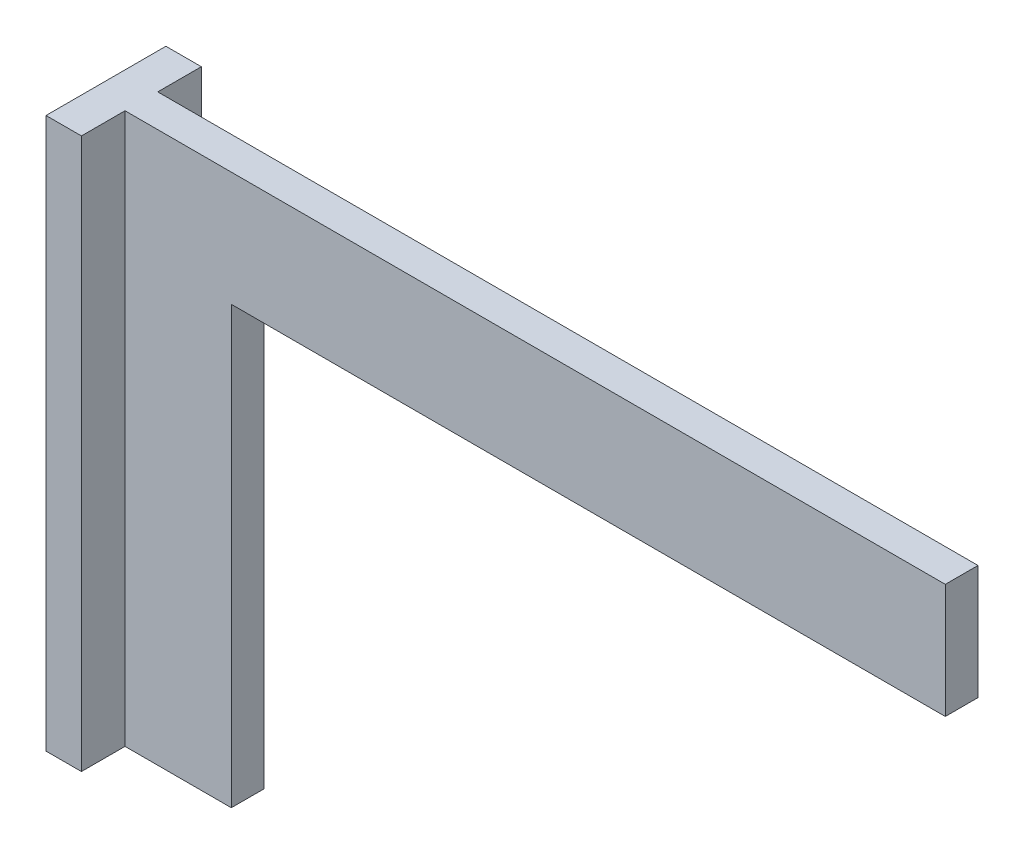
ISO-10303-21;
HEADER;
FILE_DESCRIPTION(('STEP AP214'),'2;1');
FILE_NAME('part.step','',(''),(''),'','','');
FILE_SCHEMA(('AUTOMOTIVE_DESIGN { 1 0 10303 214 1 1 1 1 }'));
ENDSEC;
DATA;
#1=APPLICATION_CONTEXT('core data for automotive mechanical design processes');
#2=APPLICATION_PROTOCOL_DEFINITION('international standard','automotive_design',2000,#1);
#3=PRODUCT_CONTEXT('',#1,'mechanical');
#4=PRODUCT('Part','Part','',(#3));
#5=PRODUCT_RELATED_PRODUCT_CATEGORY('part','',(#4));
#6=PRODUCT_DEFINITION_FORMATION('','',#4);
#7=PRODUCT_DEFINITION_CONTEXT('part definition',#1,'design');
#8=PRODUCT_DEFINITION('design','',#6,#7);
#9=PRODUCT_DEFINITION_SHAPE('','',#8);
#10=(LENGTH_UNIT() NAMED_UNIT(*) SI_UNIT(.MILLI.,.METRE.));
#11=(NAMED_UNIT(*) PLANE_ANGLE_UNIT() SI_UNIT($,.RADIAN.));
#12=(NAMED_UNIT(*) SI_UNIT($,.STERADIAN.) SOLID_ANGLE_UNIT());
#13=UNCERTAINTY_MEASURE_WITH_UNIT(LENGTH_MEASURE(1.E-05),#10,'distance_accuracy_value','');
#14=(GEOMETRIC_REPRESENTATION_CONTEXT(3) GLOBAL_UNCERTAINTY_ASSIGNED_CONTEXT((#13)) GLOBAL_UNIT_ASSIGNED_CONTEXT((#10,
#11,#12)) REPRESENTATION_CONTEXT('',''));
#15=CARTESIAN_POINT('',(0.,0.,0.));
#16=DIRECTION('',(0.,0.,1.));
#17=DIRECTION('',(1.,0.,0.));
#18=AXIS2_PLACEMENT_3D('',#15,#16,#17);
#19=CARTESIAN_POINT('',(26.,0.,6.));
#20=DIRECTION('',(0.,1.,0.));
#21=DIRECTION('',(-1.,0.,0.));
#22=AXIS2_PLACEMENT_3D('',#19,#20,#21);
#23=PLANE('',#22);
#24=DIRECTION('',(1.,0.,0.));
#25=VECTOR('',#24,1.);
#26=CARTESIAN_POINT('',(26.,0.,6.));
#27=LINE('',#26,#25);
#28=CARTESIAN_POINT('',(6.50000000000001,0.,6.));
#29=VERTEX_POINT('',#28);
#30=CARTESIAN_POINT('',(26.,0.,6.));
#31=VERTEX_POINT('',#30);
#32=EDGE_CURVE('E171',#29,#31,#27,.T.);
#33=ORIENTED_EDGE('',*,*,#32,.F.);
#34=DIRECTION('',(0.,0.,1.));
#35=VECTOR('',#34,1.);
#36=CARTESIAN_POINT('',(6.50000000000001,0.,-8.));
#37=LINE('',#36,#35);
#38=CARTESIAN_POINT('',(6.50000000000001,0.,14.));
#39=VERTEX_POINT('',#38);
#40=EDGE_CURVE('E130',#29,#39,#37,.T.);
#41=ORIENTED_EDGE('',*,*,#40,.T.);
#42=DIRECTION('',(1.,0.,0.));
#43=VECTOR('',#42,1.);
#44=CARTESIAN_POINT('',(0.,0.,14.));
#45=LINE('',#44,#43);
#46=CARTESIAN_POINT('',(0.,0.,14.));
#47=VERTEX_POINT('',#46);
#48=EDGE_CURVE('E128',#47,#39,#45,.T.);
#49=ORIENTED_EDGE('',*,*,#48,.F.);
#50=DIRECTION('',(0.,0.,-1.));
#51=VECTOR('',#50,1.);
#52=CARTESIAN_POINT('',(0.,0.,6.));
#53=LINE('',#52,#51);
#54=CARTESIAN_POINT('',(0.,0.,-8.));
#55=VERTEX_POINT('',#54);
#56=EDGE_CURVE('E116',#47,#55,#53,.T.);
#57=ORIENTED_EDGE('',*,*,#56,.T.);
#58=DIRECTION('',(1.,0.,0.));
#59=VECTOR('',#58,1.);
#60=CARTESIAN_POINT('',(0.,0.,-8.));
#61=LINE('',#60,#59);
#62=CARTESIAN_POINT('',(6.50000000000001,0.,-8.));
#63=VERTEX_POINT('',#62);
#64=EDGE_CURVE('E150',#55,#63,#61,.T.);
#65=ORIENTED_EDGE('',*,*,#64,.T.);
#66=CARTESIAN_POINT('',(6.50000000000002,0.,0.));
#67=VERTEX_POINT('',#66);
#68=EDGE_CURVE('E62',#63,#67,#37,.T.);
#69=ORIENTED_EDGE('',*,*,#68,.T.);
#70=DIRECTION('',(1.,0.,0.));
#71=VECTOR('',#70,1.);
#72=CARTESIAN_POINT('',(26.,0.,0.));
#73=LINE('',#72,#71);
#74=CARTESIAN_POINT('',(26.,0.,0.));
#75=VERTEX_POINT('',#74);
#76=EDGE_CURVE('E170',#67,#75,#73,.T.);
#77=ORIENTED_EDGE('',*,*,#76,.T.);
#78=DIRECTION('',(0.,0.,-1.));
#79=VECTOR('',#78,1.);
#80=CARTESIAN_POINT('',(26.,0.,6.));
#81=LINE('',#80,#79);
#82=EDGE_CURVE('E47',#31,#75,#81,.T.);
#83=ORIENTED_EDGE('',*,*,#82,.F.);
#84=EDGE_LOOP('',(#33,#41,#49,#57,#65,#69,#77,#83));
#85=FACE_BOUND('',#84,.T.);
#86=ADVANCED_FACE('F39',(#85),#23,.F.);
#87=CARTESIAN_POINT('',(26.,80.,6.));
#88=DIRECTION('',(-1.,0.,0.));
#89=DIRECTION('',(0.,-1.,0.));
#90=AXIS2_PLACEMENT_3D('',#87,#88,#89);
#91=PLANE('',#90);
#92=DIRECTION('',(0.,1.,0.));
#93=VECTOR('',#92,1.);
#94=CARTESIAN_POINT('',(26.,80.,0.));
#95=LINE('',#94,#93);
#96=CARTESIAN_POINT('',(26.,80.,0.));
#97=VERTEX_POINT('',#96);
#98=EDGE_CURVE('E188',#75,#97,#95,.T.);
#99=ORIENTED_EDGE('',*,*,#98,.T.);
#100=DIRECTION('',(0.,0.,-1.));
#101=VECTOR('',#100,1.);
#102=CARTESIAN_POINT('',(26.,80.,6.));
#103=LINE('',#102,#101);
#104=CARTESIAN_POINT('',(26.,80.,6.));
#105=VERTEX_POINT('',#104);
#106=EDGE_CURVE('E210',#105,#97,#103,.T.);
#107=ORIENTED_EDGE('',*,*,#106,.F.);
#108=DIRECTION('',(0.,1.,0.));
#109=VECTOR('',#108,1.);
#110=CARTESIAN_POINT('',(26.,80.,6.));
#111=LINE('',#110,#109);
#112=EDGE_CURVE('E174',#31,#105,#111,.T.);
#113=ORIENTED_EDGE('',*,*,#112,.F.);
#114=ORIENTED_EDGE('',*,*,#82,.T.);
#115=EDGE_LOOP('',(#99,#107,#113,#114));
#116=FACE_BOUND('',#115,.T.);
#117=ADVANCED_FACE('F218',(#116),#91,.F.);
#118=CARTESIAN_POINT('',(157.,80.,6.));
#119=DIRECTION('',(0.,1.,0.));
#120=DIRECTION('',(-1.,0.,0.));
#121=AXIS2_PLACEMENT_3D('',#118,#119,#120);
#122=PLANE('',#121);
#123=DIRECTION('',(1.,0.,0.));
#124=VECTOR('',#123,1.);
#125=CARTESIAN_POINT('',(157.,80.,0.));
#126=LINE('',#125,#124);
#127=CARTESIAN_POINT('',(157.,80.,0.));
#128=VERTEX_POINT('',#127);
#129=EDGE_CURVE('E191',#97,#128,#126,.T.);
#130=ORIENTED_EDGE('',*,*,#129,.T.);
#131=DIRECTION('',(0.,0.,-1.));
#132=VECTOR('',#131,1.);
#133=CARTESIAN_POINT('',(157.,80.,6.));
#134=LINE('',#133,#132);
#135=CARTESIAN_POINT('',(157.,80.,6.));
#136=VERTEX_POINT('',#135);
#137=EDGE_CURVE('E206',#136,#128,#134,.T.);
#138=ORIENTED_EDGE('',*,*,#137,.F.);
#139=DIRECTION('',(1.,0.,0.));
#140=VECTOR('',#139,1.);
#141=CARTESIAN_POINT('',(157.,80.,6.));
#142=LINE('',#141,#140);
#143=EDGE_CURVE('E178',#105,#136,#142,.T.);
#144=ORIENTED_EDGE('',*,*,#143,.F.);
#145=ORIENTED_EDGE('',*,*,#106,.T.);
#146=EDGE_LOOP('',(#130,#138,#144,#145));
#147=FACE_BOUND('',#146,.T.);
#148=ADVANCED_FACE('F230',(#147),#122,.F.);
#149=CARTESIAN_POINT('',(157.,101.,6.));
#150=DIRECTION('',(-1.,0.,0.));
#151=DIRECTION('',(0.,0.,1.));
#152=AXIS2_PLACEMENT_3D('',#149,#150,#151);
#153=PLANE('',#152);
#154=DIRECTION('',(0.,1.,0.));
#155=VECTOR('',#154,1.);
#156=CARTESIAN_POINT('',(157.,101.,0.));
#157=LINE('',#156,#155);
#158=CARTESIAN_POINT('',(157.,101.,0.));
#159=VERTEX_POINT('',#158);
#160=EDGE_CURVE('E194',#128,#159,#157,.T.);
#161=ORIENTED_EDGE('',*,*,#160,.T.);
#162=DIRECTION('',(0.,0.,-1.));
#163=VECTOR('',#162,1.);
#164=CARTESIAN_POINT('',(157.,101.,6.));
#165=LINE('',#164,#163);
#166=CARTESIAN_POINT('',(157.,101.,6.));
#167=VERTEX_POINT('',#166);
#168=EDGE_CURVE('E202',#167,#159,#165,.T.);
#169=ORIENTED_EDGE('',*,*,#168,.F.);
#170=DIRECTION('',(0.,1.,0.));
#171=VECTOR('',#170,1.);
#172=CARTESIAN_POINT('',(157.,101.,6.));
#173=LINE('',#172,#171);
#174=EDGE_CURVE('E181',#136,#167,#173,.T.);
#175=ORIENTED_EDGE('',*,*,#174,.F.);
#176=ORIENTED_EDGE('',*,*,#137,.T.);
#177=EDGE_LOOP('',(#161,#169,#175,#176));
#178=FACE_BOUND('',#177,.T.);
#179=ADVANCED_FACE('F234',(#178),#153,.F.);
#180=CARTESIAN_POINT('',(0.,101.,6.));
#181=DIRECTION('',(0.,-1.,0.));
#182=DIRECTION('',(0.,0.,-1.));
#183=AXIS2_PLACEMENT_3D('',#180,#181,#182);
#184=PLANE('',#183);
#185=DIRECTION('',(-1.,0.,0.));
#186=VECTOR('',#185,1.);
#187=CARTESIAN_POINT('',(0.,101.,0.));
#188=LINE('',#187,#186);
#189=CARTESIAN_POINT('',(6.5,101.,0.));
#190=VERTEX_POINT('',#189);
#191=EDGE_CURVE('E175',#159,#190,#188,.T.);
#192=ORIENTED_EDGE('',*,*,#191,.T.);
#193=DIRECTION('',(0.,0.,1.));
#194=VECTOR('',#193,1.);
#195=CARTESIAN_POINT('',(6.5,101.,-8.));
#196=LINE('',#195,#194);
#197=CARTESIAN_POINT('',(6.5,101.,-8.));
#198=VERTEX_POINT('',#197);
#199=EDGE_CURVE('E161',#198,#190,#196,.T.);
#200=ORIENTED_EDGE('',*,*,#199,.F.);
#201=DIRECTION('',(-1.,0.,0.));
#202=VECTOR('',#201,1.);
#203=CARTESIAN_POINT('',(0.,101.,-8.));
#204=LINE('',#203,#202);
#205=CARTESIAN_POINT('',(0.,101.,-8.));
#206=VERTEX_POINT('',#205);
#207=EDGE_CURVE('E157',#198,#206,#204,.T.);
#208=ORIENTED_EDGE('',*,*,#207,.T.);
#209=DIRECTION('',(0.,0.,-1.));
#210=VECTOR('',#209,1.);
#211=CARTESIAN_POINT('',(0.,101.,6.));
#212=LINE('',#211,#210);
#213=CARTESIAN_POINT('',(0.,101.,14.));
#214=VERTEX_POINT('',#213);
#215=EDGE_CURVE('E125',#214,#206,#212,.T.);
#216=ORIENTED_EDGE('',*,*,#215,.F.);
#217=DIRECTION('',(-1.,0.,0.));
#218=VECTOR('',#217,1.);
#219=CARTESIAN_POINT('',(0.,101.,14.));
#220=LINE('',#219,#218);
#221=CARTESIAN_POINT('',(6.5,101.,14.));
#222=VERTEX_POINT('',#221);
#223=EDGE_CURVE('E140',#222,#214,#220,.T.);
#224=ORIENTED_EDGE('',*,*,#223,.F.);
#225=CARTESIAN_POINT('',(6.50000000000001,101.,6.));
#226=VERTEX_POINT('',#225);
#227=EDGE_CURVE('E165',#226,#222,#196,.T.);
#228=ORIENTED_EDGE('',*,*,#227,.F.);
#229=DIRECTION('',(-1.,0.,0.));
#230=VECTOR('',#229,1.);
#231=CARTESIAN_POINT('',(0.,101.,6.));
#232=LINE('',#231,#230);
#233=EDGE_CURVE('E54',#167,#226,#232,.T.);
#234=ORIENTED_EDGE('',*,*,#233,.F.);
#235=ORIENTED_EDGE('',*,*,#168,.T.);
#236=EDGE_LOOP('',(#192,#200,#208,#216,#224,#228,#234,#235));
#237=FACE_BOUND('',#236,.T.);
#238=ADVANCED_FACE('F243',(#237),#184,.F.);
#239=CARTESIAN_POINT('',(0.,0.,6.));
#240=DIRECTION('',(1.,0.,0.));
#241=DIRECTION('',(0.,0.,-1.));
#242=AXIS2_PLACEMENT_3D('',#239,#240,#241);
#243=PLANE('',#242);
#244=ORIENTED_EDGE('',*,*,#215,.T.);
#245=DIRECTION('',(0.,-1.,0.));
#246=VECTOR('',#245,1.);
#247=CARTESIAN_POINT('',(0.,101.,-8.));
#248=LINE('',#247,#246);
#249=EDGE_CURVE('E122',#206,#55,#248,.T.);
#250=ORIENTED_EDGE('',*,*,#249,.T.);
#251=ORIENTED_EDGE('',*,*,#56,.F.);
#252=DIRECTION('',(0.,-1.,0.));
#253=VECTOR('',#252,1.);
#254=CARTESIAN_POINT('',(0.,101.,14.));
#255=LINE('',#254,#253);
#256=EDGE_CURVE('E120',#214,#47,#255,.T.);
#257=ORIENTED_EDGE('',*,*,#256,.F.);
#258=EDGE_LOOP('',(#244,#250,#251,#257));
#259=FACE_BOUND('',#258,.T.);
#260=ADVANCED_FACE('F118',(#259),#243,.F.);
#261=CARTESIAN_POINT('',(0.,0.,6.));
#262=DIRECTION('',(0.,0.,-1.));
#263=DIRECTION('',(-1.,0.,0.));
#264=AXIS2_PLACEMENT_3D('',#261,#262,#263);
#265=PLANE('',#264);
#266=ORIENTED_EDGE('',*,*,#233,.T.);
#267=DIRECTION('',(0.,-1.,0.));
#268=VECTOR('',#267,1.);
#269=CARTESIAN_POINT('',(6.50000000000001,0.,6.));
#270=LINE('',#269,#268);
#271=EDGE_CURVE('E164',#226,#29,#270,.T.);
#272=ORIENTED_EDGE('',*,*,#271,.T.);
#273=ORIENTED_EDGE('',*,*,#32,.T.);
#274=ORIENTED_EDGE('',*,*,#112,.T.);
#275=ORIENTED_EDGE('',*,*,#143,.T.);
#276=ORIENTED_EDGE('',*,*,#174,.T.);
#277=EDGE_LOOP('',(#266,#272,#273,#274,#275,#276));
#278=FACE_BOUND('',#277,.T.);
#279=ADVANCED_FACE('F236',(#278),#265,.F.);
#280=CARTESIAN_POINT('',(0.,0.,0.));
#281=DIRECTION('',(0.,0.,-1.));
#282=DIRECTION('',(-1.,0.,0.));
#283=AXIS2_PLACEMENT_3D('',#280,#281,#282);
#284=PLANE('',#283);
#285=DIRECTION('',(0.,-1.,0.));
#286=VECTOR('',#285,1.);
#287=CARTESIAN_POINT('',(6.50000000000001,0.,0.));
#288=LINE('',#287,#286);
#289=EDGE_CURVE('E11',#190,#67,#288,.T.);
#290=ORIENTED_EDGE('',*,*,#289,.F.);
#291=ORIENTED_EDGE('',*,*,#191,.F.);
#292=ORIENTED_EDGE('',*,*,#160,.F.);
#293=ORIENTED_EDGE('',*,*,#129,.F.);
#294=ORIENTED_EDGE('',*,*,#98,.F.);
#295=ORIENTED_EDGE('',*,*,#76,.F.);
#296=EDGE_LOOP('',(#290,#291,#292,#293,#294,#295));
#297=FACE_BOUND('',#296,.T.);
#298=ADVANCED_FACE('F225',(#297),#284,.T.);
#299=CARTESIAN_POINT('',(0.,0.,-8.));
#300=DIRECTION('',(0.,0.,1.));
#301=DIRECTION('',(1.,0.,0.));
#302=AXIS2_PLACEMENT_3D('',#299,#300,#301);
#303=PLANE('',#302);
#304=ORIENTED_EDGE('',*,*,#249,.F.);
#305=ORIENTED_EDGE('',*,*,#207,.F.);
#306=DIRECTION('',(0.,1.,0.));
#307=VECTOR('',#306,1.);
#308=CARTESIAN_POINT('',(6.5,101.,-8.));
#309=LINE('',#308,#307);
#310=EDGE_CURVE('E153',#63,#198,#309,.T.);
#311=ORIENTED_EDGE('',*,*,#310,.F.);
#312=ORIENTED_EDGE('',*,*,#64,.F.);
#313=EDGE_LOOP('',(#304,#305,#311,#312));
#314=FACE_BOUND('',#313,.T.);
#315=ADVANCED_FACE('F246',(#314),#303,.F.);
#316=CARTESIAN_POINT('',(6.5,101.,-8.));
#317=DIRECTION('',(1.,0.,0.));
#318=DIRECTION('',(0.,1.,0.));
#319=AXIS2_PLACEMENT_3D('',#316,#317,#318);
#320=PLANE('',#319);
#321=ORIENTED_EDGE('',*,*,#199,.T.);
#322=ORIENTED_EDGE('',*,*,#289,.T.);
#323=ORIENTED_EDGE('',*,*,#68,.F.);
#324=ORIENTED_EDGE('',*,*,#310,.T.);
#325=EDGE_LOOP('',(#321,#322,#323,#324));
#326=FACE_BOUND('',#325,.T.);
#327=ADVANCED_FACE('F249',(#326),#320,.T.);
#328=ORIENTED_EDGE('',*,*,#271,.F.);
#329=ORIENTED_EDGE('',*,*,#227,.T.);
#330=DIRECTION('',(0.,1.,0.));
#331=VECTOR('',#330,1.);
#332=CARTESIAN_POINT('',(6.5,101.,14.));
#333=LINE('',#332,#331);
#334=EDGE_CURVE('E135',#39,#222,#333,.T.);
#335=ORIENTED_EDGE('',*,*,#334,.F.);
#336=ORIENTED_EDGE('',*,*,#40,.F.);
#337=EDGE_LOOP('',(#328,#329,#335,#336));
#338=FACE_BOUND('',#337,.T.);
#339=ADVANCED_FACE('F239',(#338),#320,.T.);
#340=CARTESIAN_POINT('',(0.,0.,14.));
#341=DIRECTION('',(0.,0.,1.));
#342=DIRECTION('',(1.,0.,0.));
#343=AXIS2_PLACEMENT_3D('',#340,#341,#342);
#344=PLANE('',#343);
#345=ORIENTED_EDGE('',*,*,#256,.T.);
#346=ORIENTED_EDGE('',*,*,#48,.T.);
#347=ORIENTED_EDGE('',*,*,#334,.T.);
#348=ORIENTED_EDGE('',*,*,#223,.T.);
#349=EDGE_LOOP('',(#345,#346,#347,#348));
#350=FACE_BOUND('',#349,.T.);
#351=ADVANCED_FACE('F138',(#350),#344,.T.);
#352=CLOSED_SHELL('',(#86,#117,#148,#179,#238,#260,#279,#298,#315,#327,#339,#351));
#353=MANIFOLD_SOLID_BREP('B2',#352);
#354=ADVANCED_BREP_SHAPE_REPRESENTATION('',(#18,#353),#14);
#355=SHAPE_DEFINITION_REPRESENTATION(#9,#354);
ENDSEC;
END-ISO-10303-21;
